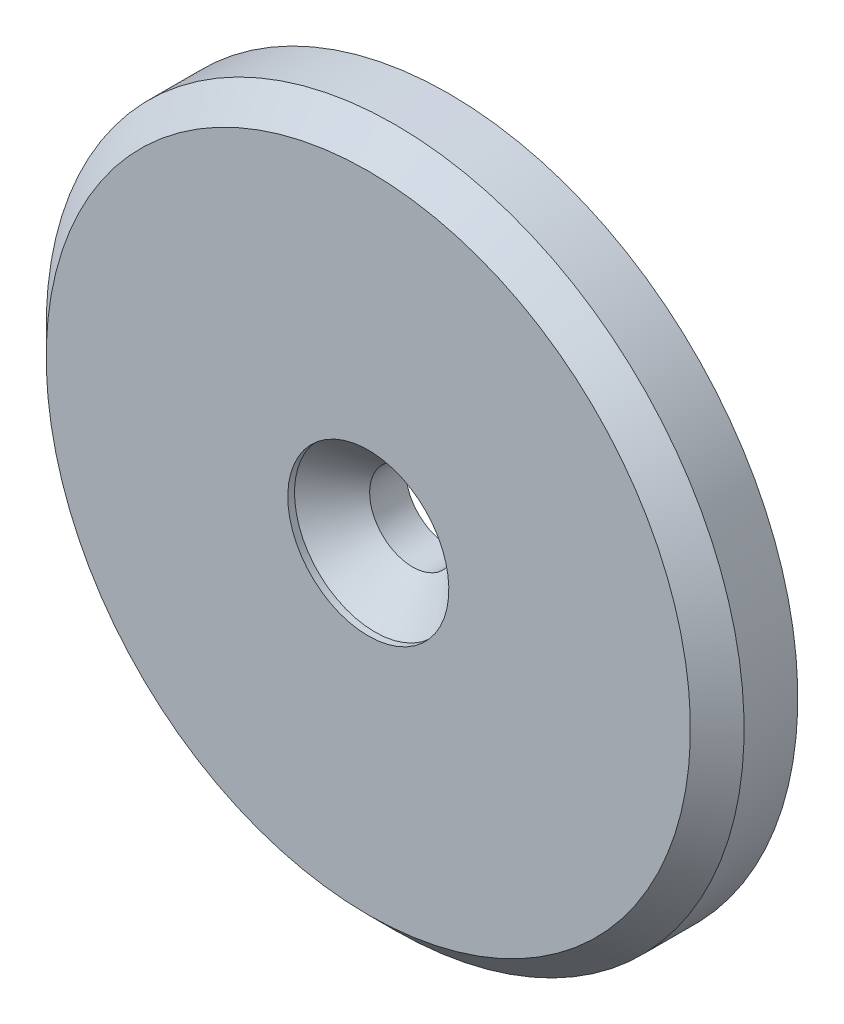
ISO-10303-21;
HEADER;
FILE_DESCRIPTION(('STEP AP214'),'2;1');
FILE_NAME('part.step','',(''),(''),'','','');
FILE_SCHEMA(('AUTOMOTIVE_DESIGN { 1 0 10303 214 1 1 1 1 }'));
ENDSEC;
DATA;
#1=APPLICATION_CONTEXT('core data for automotive mechanical design processes');
#2=APPLICATION_PROTOCOL_DEFINITION('international standard','automotive_design',2000,#1);
#3=PRODUCT_CONTEXT('',#1,'mechanical');
#4=PRODUCT('Part','Part','',(#3));
#5=PRODUCT_RELATED_PRODUCT_CATEGORY('part','',(#4));
#6=PRODUCT_DEFINITION_FORMATION('','',#4);
#7=PRODUCT_DEFINITION_CONTEXT('part definition',#1,'design');
#8=PRODUCT_DEFINITION('design','',#6,#7);
#9=PRODUCT_DEFINITION_SHAPE('','',#8);
#10=(LENGTH_UNIT() NAMED_UNIT(*) SI_UNIT(.MILLI.,.METRE.));
#11=(NAMED_UNIT(*) PLANE_ANGLE_UNIT() SI_UNIT($,.RADIAN.));
#12=(NAMED_UNIT(*) SI_UNIT($,.STERADIAN.) SOLID_ANGLE_UNIT());
#13=UNCERTAINTY_MEASURE_WITH_UNIT(LENGTH_MEASURE(1.E-05),#10,'distance_accuracy_value','');
#14=(GEOMETRIC_REPRESENTATION_CONTEXT(3) GLOBAL_UNCERTAINTY_ASSIGNED_CONTEXT((#13)) GLOBAL_UNIT_ASSIGNED_CONTEXT((#10,
#11,#12)) REPRESENTATION_CONTEXT('',''));
#15=CARTESIAN_POINT('',(0.,0.,0.));
#16=DIRECTION('',(0.,0.,1.));
#17=DIRECTION('',(1.,0.,0.));
#18=AXIS2_PLACEMENT_3D('',#15,#16,#17);
#19=CARTESIAN_POINT('',(0.,0.,2.7));
#20=DIRECTION('',(0.,0.,1.));
#21=DIRECTION('',(0.,-1.,0.));
#22=AXIS2_PLACEMENT_3D('',#19,#20,#21);
#23=CONICAL_SURFACE('',#22,3.2,0.785398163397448);
#24=CARTESIAN_POINT('',(0.,0.,5.5));
#25=DIRECTION('',(0.,0.,1.));
#26=DIRECTION('',(0.,-1.,0.));
#27=AXIS2_PLACEMENT_3D('',#24,#25,#26);
#28=CIRCLE('',#27,6.);
#29=CARTESIAN_POINT('',(0.,-6.,5.5));
#30=VERTEX_POINT('',#29);
#31=EDGE_CURVE('E37',#30,#30,#28,.T.);
#32=ORIENTED_EDGE('',*,*,#31,.T.);
#33=EDGE_LOOP('',(#32));
#34=FACE_BOUND('',#33,.T.);
#35=CARTESIAN_POINT('',(0.,0.,2.7));
#36=DIRECTION('',(0.,0.,1.));
#37=DIRECTION('',(0.,-1.,0.));
#38=AXIS2_PLACEMENT_3D('',#35,#36,#37);
#39=CIRCLE('',#38,3.2);
#40=CARTESIAN_POINT('',(0.,-3.2,2.7));
#41=VERTEX_POINT('',#40);
#42=EDGE_CURVE('E8',#41,#41,#39,.T.);
#43=ORIENTED_EDGE('',*,*,#42,.F.);
#44=EDGE_LOOP('',(#43));
#45=FACE_BOUND('',#44,.T.);
#46=ADVANCED_FACE('F12',(#34,#45),#23,.F.);
#47=CARTESIAN_POINT('',(0.,0.,6.76419892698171));
#48=DIRECTION('',(0.,0.,1.));
#49=DIRECTION('',(0.,-1.,0.));
#50=AXIS2_PLACEMENT_3D('',#47,#48,#49);
#51=CYLINDRICAL_SURFACE('',#50,3.2);
#52=ORIENTED_EDGE('',*,*,#42,.T.);
#53=EDGE_LOOP('',(#52));
#54=FACE_BOUND('',#53,.T.);
#55=CARTESIAN_POINT('',(0.,0.,0.));
#56=DIRECTION('',(0.,0.,1.));
#57=DIRECTION('',(0.,-1.,0.));
#58=AXIS2_PLACEMENT_3D('',#55,#56,#57);
#59=CIRCLE('',#58,3.2);
#60=CARTESIAN_POINT('',(0.,-3.2,0.));
#61=VERTEX_POINT('',#60);
#62=EDGE_CURVE('E18',#61,#61,#59,.T.);
#63=ORIENTED_EDGE('',*,*,#62,.F.);
#64=EDGE_LOOP('',(#63));
#65=FACE_BOUND('',#64,.T.);
#66=ADVANCED_FACE('F57',(#54,#65),#51,.F.);
#67=CARTESIAN_POINT('',(-3.2,0.,0.));
#68=DIRECTION('',(0.,0.,-1.));
#69=DIRECTION('',(0.,1.,0.));
#70=AXIS2_PLACEMENT_3D('',#67,#68,#69);
#71=PLANE('',#70);
#72=ORIENTED_EDGE('',*,*,#62,.T.);
#73=EDGE_LOOP('',(#72));
#74=FACE_BOUND('',#73,.T.);
#75=CARTESIAN_POINT('',(0.,0.,0.));
#76=DIRECTION('',(0.,0.,1.));
#77=DIRECTION('',(0.,-1.,0.));
#78=AXIS2_PLACEMENT_3D('',#75,#76,#77);
#79=CIRCLE('',#78,26.);
#80=CARTESIAN_POINT('',(0.,-26.,0.));
#81=VERTEX_POINT('',#80);
#82=EDGE_CURVE('E22',#81,#81,#79,.T.);
#83=ORIENTED_EDGE('',*,*,#82,.F.);
#84=EDGE_LOOP('',(#83));
#85=FACE_BOUND('',#84,.T.);
#86=ADVANCED_FACE('F62',(#74,#85),#71,.T.);
#87=CARTESIAN_POINT('',(0.,0.,6.76419892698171));
#88=DIRECTION('',(0.,0.,1.));
#89=DIRECTION('',(0.,-1.,0.));
#90=AXIS2_PLACEMENT_3D('',#87,#88,#89);
#91=CYLINDRICAL_SURFACE('',#90,26.);
#92=ORIENTED_EDGE('',*,*,#82,.T.);
#93=EDGE_LOOP('',(#92));
#94=FACE_BOUND('',#93,.T.);
#95=CARTESIAN_POINT('',(0.,0.,4.));
#96=DIRECTION('',(0.,0.,1.));
#97=DIRECTION('',(0.,-1.,0.));
#98=AXIS2_PLACEMENT_3D('',#95,#96,#97);
#99=CIRCLE('',#98,26.);
#100=CARTESIAN_POINT('',(0.,-26.,4.));
#101=VERTEX_POINT('',#100);
#102=EDGE_CURVE('E26',#101,#101,#99,.T.);
#103=ORIENTED_EDGE('',*,*,#102,.F.);
#104=EDGE_LOOP('',(#103));
#105=FACE_BOUND('',#104,.T.);
#106=ADVANCED_FACE('F67',(#94,#105),#91,.T.);
#107=CARTESIAN_POINT('',(0.,0.,6.));
#108=DIRECTION('',(0.,0.,-1.));
#109=DIRECTION('',(0.,1.,0.));
#110=AXIS2_PLACEMENT_3D('',#107,#108,#109);
#111=CONICAL_SURFACE('',#110,24.,0.785398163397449);
#112=ORIENTED_EDGE('',*,*,#102,.T.);
#113=EDGE_LOOP('',(#112));
#114=FACE_BOUND('',#113,.T.);
#115=CARTESIAN_POINT('',(0.,0.,6.));
#116=DIRECTION('',(0.,0.,1.));
#117=DIRECTION('',(0.,-1.,0.));
#118=AXIS2_PLACEMENT_3D('',#115,#116,#117);
#119=CIRCLE('',#118,24.);
#120=CARTESIAN_POINT('',(0.,-24.,6.));
#121=VERTEX_POINT('',#120);
#122=EDGE_CURVE('E31',#121,#121,#119,.T.);
#123=ORIENTED_EDGE('',*,*,#122,.F.);
#124=EDGE_LOOP('',(#123));
#125=FACE_BOUND('',#124,.T.);
#126=ADVANCED_FACE('F53',(#114,#125),#111,.T.);
#127=CARTESIAN_POINT('',(-6.,0.,6.));
#128=DIRECTION('',(0.,0.,1.));
#129=DIRECTION('',(0.,-1.,0.));
#130=AXIS2_PLACEMENT_3D('',#127,#128,#129);
#131=PLANE('',#130);
#132=ORIENTED_EDGE('',*,*,#122,.T.);
#133=EDGE_LOOP('',(#132));
#134=FACE_BOUND('',#133,.T.);
#135=CARTESIAN_POINT('',(0.,0.,6.));
#136=DIRECTION('',(0.,0.,1.));
#137=DIRECTION('',(0.,-1.,0.));
#138=AXIS2_PLACEMENT_3D('',#135,#136,#137);
#139=CIRCLE('',#138,6.);
#140=CARTESIAN_POINT('',(0.,-6.,6.));
#141=VERTEX_POINT('',#140);
#142=EDGE_CURVE('E34',#141,#141,#139,.T.);
#143=ORIENTED_EDGE('',*,*,#142,.F.);
#144=EDGE_LOOP('',(#143));
#145=FACE_BOUND('',#144,.T.);
#146=ADVANCED_FACE('F45',(#134,#145),#131,.T.);
#147=CARTESIAN_POINT('',(0.,0.,6.76419892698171));
#148=DIRECTION('',(0.,0.,1.));
#149=DIRECTION('',(0.,-1.,0.));
#150=AXIS2_PLACEMENT_3D('',#147,#148,#149);
#151=CYLINDRICAL_SURFACE('',#150,6.);
#152=ORIENTED_EDGE('',*,*,#142,.T.);
#153=EDGE_LOOP('',(#152));
#154=FACE_BOUND('',#153,.T.);
#155=ORIENTED_EDGE('',*,*,#31,.F.);
#156=EDGE_LOOP('',(#155));
#157=FACE_BOUND('',#156,.T.);
#158=ADVANCED_FACE('F43',(#154,#157),#151,.F.);
#159=CLOSED_SHELL('',(#46,#66,#86,#106,#126,#146,#158));
#160=MANIFOLD_SOLID_BREP('B1',#159);
#161=ADVANCED_BREP_SHAPE_REPRESENTATION('',(#18,#160),#14);
#162=SHAPE_DEFINITION_REPRESENTATION(#9,#161);
ENDSEC;
END-ISO-10303-21;
